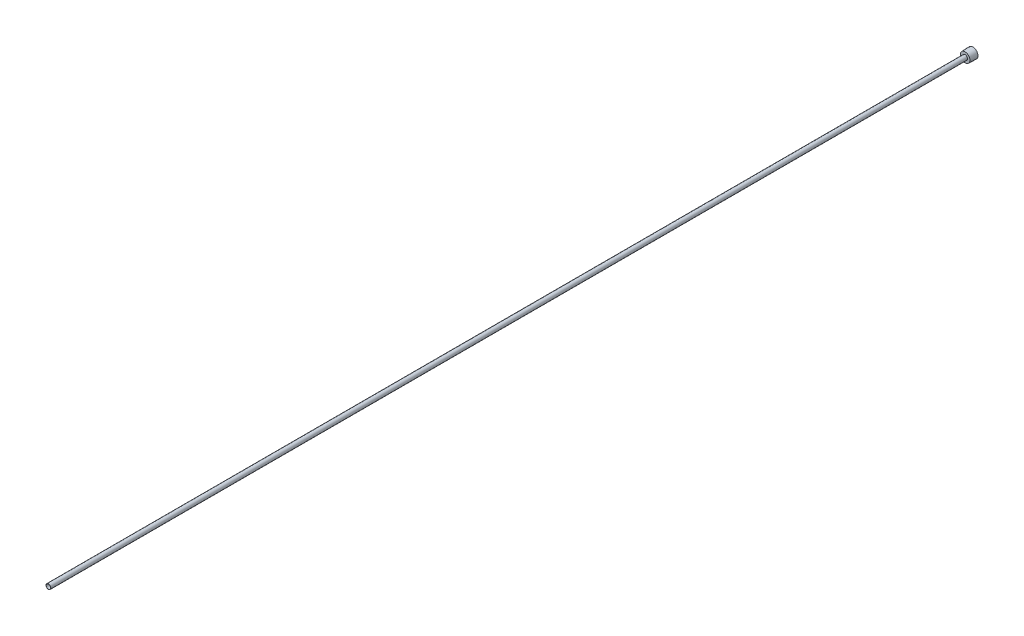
ISO-10303-21;
HEADER;
FILE_DESCRIPTION(('STEP AP214'),'2;1');
FILE_NAME('part.step','',(''),(''),'','','');
FILE_SCHEMA(('AUTOMOTIVE_DESIGN { 1 0 10303 214 1 1 1 1 }'));
ENDSEC;
DATA;
#1=APPLICATION_CONTEXT('core data for automotive mechanical design processes');
#2=APPLICATION_PROTOCOL_DEFINITION('international standard','automotive_design',2000,#1);
#3=PRODUCT_CONTEXT('',#1,'mechanical');
#4=PRODUCT('Part','Part','',(#3));
#5=PRODUCT_RELATED_PRODUCT_CATEGORY('part','',(#4));
#6=PRODUCT_DEFINITION_FORMATION('','',#4);
#7=PRODUCT_DEFINITION_CONTEXT('part definition',#1,'design');
#8=PRODUCT_DEFINITION('design','',#6,#7);
#9=PRODUCT_DEFINITION_SHAPE('','',#8);
#10=(LENGTH_UNIT() NAMED_UNIT(*) SI_UNIT(.MILLI.,.METRE.));
#11=(NAMED_UNIT(*) PLANE_ANGLE_UNIT() SI_UNIT($,.RADIAN.));
#12=(NAMED_UNIT(*) SI_UNIT($,.STERADIAN.) SOLID_ANGLE_UNIT());
#13=UNCERTAINTY_MEASURE_WITH_UNIT(LENGTH_MEASURE(1.E-05),#10,'distance_accuracy_value','');
#14=(GEOMETRIC_REPRESENTATION_CONTEXT(3) GLOBAL_UNCERTAINTY_ASSIGNED_CONTEXT((#13)) GLOBAL_UNIT_ASSIGNED_CONTEXT((#10,
#11,#12)) REPRESENTATION_CONTEXT('',''));
#15=CARTESIAN_POINT('',(0.,0.,0.));
#16=DIRECTION('',(0.,0.,1.));
#17=DIRECTION('',(1.,0.,0.));
#18=AXIS2_PLACEMENT_3D('',#15,#16,#17);
#19=CARTESIAN_POINT('',(0.,0.,0.));
#20=DIRECTION('',(0.,0.,1.));
#21=DIRECTION('',(1.,0.,0.));
#22=AXIS2_PLACEMENT_3D('',#19,#20,#21);
#23=CYLINDRICAL_SURFACE('',#22,2.921);
#24=CARTESIAN_POINT('',(0.,0.,1219.2));
#25=DIRECTION('',(0.,0.,1.));
#26=DIRECTION('',(1.,0.,0.));
#27=AXIS2_PLACEMENT_3D('',#24,#25,#26);
#28=CIRCLE('',#27,2.921);
#29=CARTESIAN_POINT('',(2.921,0.,1219.2));
#30=VERTEX_POINT('',#29);
#31=EDGE_CURVE('E142',#30,#30,#28,.T.);
#32=CARTESIAN_POINT('',(0.,0.,6.35));
#33=DIRECTION('',(0.,0.,-1.));
#34=DIRECTION('',(-1.,0.,0.));
#35=AXIS2_PLACEMENT_3D('',#32,#33,#34);
#36=CIRCLE('',#35,2.921);
#37=CARTESIAN_POINT('',(2.921,0.,6.35));
#38=VERTEX_POINT('',#37);
#39=EDGE_CURVE('E37',#38,#38,#36,.F.);
#40=CARTESIAN_POINT('',(2.921,0.,1219.2));
#41=CARTESIAN_POINT('',(2.921,0.,1206.56614583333));
#42=CARTESIAN_POINT('',(2.921,0.,1193.93229166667));
#43=CARTESIAN_POINT('',(2.921,0.,1168.66458333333));
#44=CARTESIAN_POINT('',(2.921,0.,1156.03072916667));
#45=CARTESIAN_POINT('',(2.921,0.,1130.76302083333));
#46=CARTESIAN_POINT('',(2.921,0.,1118.12916666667));
#47=CARTESIAN_POINT('',(2.921,0.,1092.86145833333));
#48=CARTESIAN_POINT('',(2.921,0.,1080.22760416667));
#49=CARTESIAN_POINT('',(2.921,0.,1054.95989583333));
#50=CARTESIAN_POINT('',(2.921,0.,1042.32604166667));
#51=CARTESIAN_POINT('',(2.921,0.,1017.05833333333));
#52=CARTESIAN_POINT('',(2.921,0.,1004.42447916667));
#53=CARTESIAN_POINT('',(2.921,0.,979.156770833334));
#54=CARTESIAN_POINT('',(2.921,0.,966.522916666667));
#55=CARTESIAN_POINT('',(2.921,0.,941.255208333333));
#56=CARTESIAN_POINT('',(2.921,0.,928.621354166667));
#57=CARTESIAN_POINT('',(2.921,0.,903.353645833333));
#58=CARTESIAN_POINT('',(2.921,0.,890.719791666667));
#59=CARTESIAN_POINT('',(2.921,0.,865.452083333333));
#60=CARTESIAN_POINT('',(2.921,0.,852.818229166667));
#61=CARTESIAN_POINT('',(2.921,0.,827.550520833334));
#62=CARTESIAN_POINT('',(2.921,0.,814.916666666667));
#63=CARTESIAN_POINT('',(2.921,0.,789.648958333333));
#64=CARTESIAN_POINT('',(2.921,0.,777.015104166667));
#65=CARTESIAN_POINT('',(2.921,0.,751.747395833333));
#66=CARTESIAN_POINT('',(2.921,0.,739.113541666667));
#67=CARTESIAN_POINT('',(2.921,0.,713.845833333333));
#68=CARTESIAN_POINT('',(2.921,0.,701.211979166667));
#69=CARTESIAN_POINT('',(2.921,0.,675.944270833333));
#70=CARTESIAN_POINT('',(2.921,0.,663.310416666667));
#71=CARTESIAN_POINT('',(2.921,0.,638.042708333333));
#72=CARTESIAN_POINT('',(2.921,0.,625.408854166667));
#73=CARTESIAN_POINT('',(2.921,0.,600.141145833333));
#74=CARTESIAN_POINT('',(2.921,0.,587.507291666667));
#75=CARTESIAN_POINT('',(2.921,0.,562.239583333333));
#76=CARTESIAN_POINT('',(2.921,0.,549.605729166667));
#77=CARTESIAN_POINT('',(2.921,0.,524.338020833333));
#78=CARTESIAN_POINT('',(2.921,0.,511.704166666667));
#79=CARTESIAN_POINT('',(2.921,0.,486.436458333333));
#80=CARTESIAN_POINT('',(2.921,0.,473.802604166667));
#81=CARTESIAN_POINT('',(2.921,0.,448.534895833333));
#82=CARTESIAN_POINT('',(2.921,0.,435.901041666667));
#83=CARTESIAN_POINT('',(2.921,0.,410.633333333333));
#84=CARTESIAN_POINT('',(2.921,0.,397.999479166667));
#85=CARTESIAN_POINT('',(2.921,0.,372.731770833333));
#86=CARTESIAN_POINT('',(2.921,0.,360.097916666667));
#87=CARTESIAN_POINT('',(2.921,0.,334.830208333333));
#88=CARTESIAN_POINT('',(2.921,0.,322.196354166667));
#89=CARTESIAN_POINT('',(2.921,0.,296.928645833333));
#90=CARTESIAN_POINT('',(2.921,0.,284.294791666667));
#91=CARTESIAN_POINT('',(2.921,0.,259.027083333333));
#92=CARTESIAN_POINT('',(2.921,0.,246.393229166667));
#93=CARTESIAN_POINT('',(2.921,0.,221.125520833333));
#94=CARTESIAN_POINT('',(2.921,0.,208.491666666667));
#95=CARTESIAN_POINT('',(2.921,0.,183.223958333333));
#96=CARTESIAN_POINT('',(2.921,0.,170.590104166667));
#97=CARTESIAN_POINT('',(2.921,0.,145.322395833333));
#98=CARTESIAN_POINT('',(2.921,0.,132.688541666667));
#99=CARTESIAN_POINT('',(2.921,0.,107.420833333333));
#100=CARTESIAN_POINT('',(2.921,0.,94.7869791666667));
#101=CARTESIAN_POINT('',(2.921,0.,69.5192708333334));
#102=CARTESIAN_POINT('',(2.921,0.,56.8854166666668));
#103=CARTESIAN_POINT('',(2.921,0.,31.6177083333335));
#104=CARTESIAN_POINT('',(2.921,0.,18.9838541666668));
#105=CARTESIAN_POINT('',(2.921,0.,6.35000000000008));
#106=B_SPLINE_CURVE_WITH_KNOTS('',3,(#40,#41,#42,#43,#44,#45,#46,#47,#48,#49,#50,#51,#52,#53,
#54,#55,#56,#57,#58,#59,#60,#61,#62,#63,#64,#65,#66,#67,#68,#69,#70,#71,#72,#73,#74,#75,#76,#77,
#78,#79,#80,#81,#82,#83,#84,#85,#86,#87,#88,#89,#90,#91,#92,#93,#94,#95,#96,#97,#98,#99,#100,
#101,#102,#103,#104,#105),.UNSPECIFIED.,.F.,.F.,(4,2,2,2,2,2,2,2,2,2,2,2,2,2,2,2,2,2,2,2,2,2,2,
2,2,2,2,2,2,2,2,2,4),(0.,37.9015625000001,75.803125,113.7046875,151.60625,189.5078125,
227.409375,265.3109375,303.2125,341.1140625,379.015625,416.9171875,454.81875,492.7203125,
530.621875,568.5234375,606.425,644.3265625,682.228125,720.1296875,758.03125,795.9328125,
833.834375,871.7359375,909.6375,947.5390625,985.440625,1023.3421875,1061.24375,1099.1453125,
1137.046875,1174.9484375,1212.85),.UNSPECIFIED.);
#107=EDGE_CURVE('BSEAM33',#30,#38,#106,.T.);
#108=ORIENTED_EDGE('',*,*,#31,.T.);
#109=ORIENTED_EDGE('',*,*,#39,.F.);
#110=ORIENTED_EDGE('',*,*,#107,.T.);
#111=ORIENTED_EDGE('',*,*,#107,.F.);
#112=EDGE_LOOP('',(#108,#110,#109,#111));
#113=FACE_BOUND('',#112,.T.);
#114=ADVANCED_FACE('F33',(#113),#23,.F.);
#115=CARTESIAN_POINT('',(0.,0.,0.));
#116=DIRECTION('',(0.,0.,-1.));
#117=DIRECTION('',(-1.,0.,0.));
#118=AXIS2_PLACEMENT_3D('',#115,#116,#117);
#119=CONICAL_SURFACE('',#118,6.7183,0.0364599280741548);
#120=CARTESIAN_POINT('',(0.,0.,10.3124));
#121=DIRECTION('',(0.,0.,1.));
#122=DIRECTION('',(1.,0.,0.));
#123=AXIS2_PLACEMENT_3D('',#120,#121,#122);
#124=CIRCLE('',#123,6.34214394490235);
#125=CARTESIAN_POINT('',(6.34214394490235,0.,10.3124));
#126=VERTEX_POINT('',#125);
#127=EDGE_CURVE('E11',#126,#126,#124,.T.);
#128=ORIENTED_EDGE('',*,*,#127,.F.);
#129=EDGE_LOOP('',(#128));
#130=FACE_BOUND('',#129,.T.);
#131=CARTESIAN_POINT('',(0.,0.,0.));
#132=DIRECTION('',(0.,0.,1.));
#133=DIRECTION('',(1.,0.,0.));
#134=AXIS2_PLACEMENT_3D('',#131,#132,#133);
#135=CIRCLE('',#134,6.7183);
#136=CARTESIAN_POINT('',(6.7183,0.,0.));
#137=VERTEX_POINT('',#136);
#138=EDGE_CURVE('E145',#137,#137,#135,.T.);
#139=ORIENTED_EDGE('',*,*,#138,.T.);
#140=EDGE_LOOP('',(#139));
#141=FACE_BOUND('',#140,.T.);
#142=ADVANCED_FACE('F35',(#130,#141),#119,.T.);
#143=CARTESIAN_POINT('',(0.,6.34214394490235,10.3124));
#144=DIRECTION('',(0.,0.,-1.));
#145=DIRECTION('',(-1.,0.,0.));
#146=AXIS2_PLACEMENT_3D('',#143,#144,#145);
#147=PLANE('',#146);
#148=CARTESIAN_POINT('',(0.,0.,10.3124));
#149=DIRECTION('',(0.,0.,1.));
#150=DIRECTION('',(1.,0.,0.));
#151=AXIS2_PLACEMENT_3D('',#148,#149,#150);
#152=CIRCLE('',#151,3.175);
#153=CARTESIAN_POINT('',(3.175,0.,10.3124));
#154=VERTEX_POINT('',#153);
#155=EDGE_CURVE('E42',#154,#154,#152,.T.);
#156=ORIENTED_EDGE('',*,*,#155,.F.);
#157=EDGE_LOOP('',(#156));
#158=FACE_BOUND('',#157,.T.);
#159=ORIENTED_EDGE('',*,*,#127,.T.);
#160=EDGE_LOOP('',(#159));
#161=FACE_BOUND('',#160,.T.);
#162=ADVANCED_FACE('F156',(#158,#161),#147,.F.);
#163=CARTESIAN_POINT('',(0.,0.,331.124179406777));
#164=DIRECTION('',(0.,0.,1.));
#165=DIRECTION('',(1.,0.,0.));
#166=AXIS2_PLACEMENT_3D('',#163,#164,#165);
#167=CYLINDRICAL_SURFACE('',#166,3.17499999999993);
#168=CARTESIAN_POINT('',(0.,0.,1219.2));
#169=DIRECTION('',(0.,0.,1.));
#170=DIRECTION('',(1.,0.,0.));
#171=AXIS2_PLACEMENT_3D('',#168,#169,#170);
#172=CIRCLE('',#171,3.17499999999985);
#173=CARTESIAN_POINT('',(3.17499999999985,0.,1219.2));
#174=VERTEX_POINT('',#173);
#175=EDGE_CURVE('E148',#174,#174,#172,.T.);
#176=ORIENTED_EDGE('',*,*,#175,.F.);
#177=EDGE_LOOP('',(#176));
#178=FACE_BOUND('',#177,.T.);
#179=ORIENTED_EDGE('',*,*,#155,.T.);
#180=EDGE_LOOP('',(#179));
#181=FACE_BOUND('',#180,.T.);
#182=ADVANCED_FACE('F154',(#178,#181),#167,.T.);
#183=CARTESIAN_POINT('',(0.,3.17499999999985,1219.2));
#184=DIRECTION('',(0.,0.,-1.));
#185=DIRECTION('',(-1.,0.,0.));
#186=AXIS2_PLACEMENT_3D('',#183,#184,#185);
#187=PLANE('',#186);
#188=ORIENTED_EDGE('',*,*,#31,.F.);
#189=EDGE_LOOP('',(#188));
#190=FACE_BOUND('',#189,.T.);
#191=ORIENTED_EDGE('',*,*,#175,.T.);
#192=EDGE_LOOP('',(#191));
#193=FACE_BOUND('',#192,.T.);
#194=ADVANCED_FACE('F167',(#190,#193),#187,.F.);
#195=CARTESIAN_POINT('',(0.,0.,0.));
#196=DIRECTION('',(0.,0.,1.));
#197=DIRECTION('',(1.,0.,0.));
#198=AXIS2_PLACEMENT_3D('',#195,#196,#197);
#199=PLANE('',#198);
#200=DIRECTION('',(-0.866025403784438,-0.5,0.));
#201=VECTOR('',#200,1.);
#202=CARTESIAN_POINT('',(3.175,-1.83308710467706,0.));
#203=LINE('',#202,#201);
#204=CARTESIAN_POINT('',(3.175,-1.83308710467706,0.));
#205=VERTEX_POINT('',#204);
#206=CARTESIAN_POINT('',(0.,-3.66617420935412,0.));
#207=VERTEX_POINT('',#206);
#208=EDGE_CURVE('E124',#205,#207,#203,.T.);
#209=ORIENTED_EDGE('',*,*,#208,.F.);
#210=DIRECTION('',(0.,-1.,0.));
#211=VECTOR('',#210,1.);
#212=CARTESIAN_POINT('',(3.175,1.83308710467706,0.));
#213=LINE('',#212,#211);
#214=CARTESIAN_POINT('',(3.175,1.83308710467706,0.));
#215=VERTEX_POINT('',#214);
#216=EDGE_CURVE('E49',#215,#205,#213,.T.);
#217=ORIENTED_EDGE('',*,*,#216,.F.);
#218=DIRECTION('',(0.866025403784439,-0.5,0.));
#219=VECTOR('',#218,1.);
#220=CARTESIAN_POINT('',(0.,3.66617420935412,0.));
#221=LINE('',#220,#219);
#222=CARTESIAN_POINT('',(0.,3.66617420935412,0.));
#223=VERTEX_POINT('',#222);
#224=EDGE_CURVE('E133',#223,#215,#221,.T.);
#225=ORIENTED_EDGE('',*,*,#224,.F.);
#226=DIRECTION('',(0.866025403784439,0.5,0.));
#227=VECTOR('',#226,1.);
#228=CARTESIAN_POINT('',(-3.175,1.83308710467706,0.));
#229=LINE('',#228,#227);
#230=CARTESIAN_POINT('',(-3.175,1.83308710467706,0.));
#231=VERTEX_POINT('',#230);
#232=EDGE_CURVE('E131',#231,#223,#229,.T.);
#233=ORIENTED_EDGE('',*,*,#232,.F.);
#234=DIRECTION('',(0.,1.,0.));
#235=VECTOR('',#234,1.);
#236=CARTESIAN_POINT('',(-3.175,-1.83308710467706,0.));
#237=LINE('',#236,#235);
#238=CARTESIAN_POINT('',(-3.175,-1.83308710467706,0.));
#239=VERTEX_POINT('',#238);
#240=EDGE_CURVE('E97',#239,#231,#237,.T.);
#241=ORIENTED_EDGE('',*,*,#240,.F.);
#242=DIRECTION('',(-0.866025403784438,0.5,0.));
#243=VECTOR('',#242,1.);
#244=CARTESIAN_POINT('',(0.,-3.66617420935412,0.));
#245=LINE('',#244,#243);
#246=EDGE_CURVE('E127',#207,#239,#245,.T.);
#247=ORIENTED_EDGE('',*,*,#246,.F.);
#248=EDGE_LOOP('',(#209,#217,#225,#233,#241,#247));
#249=FACE_BOUND('',#248,.T.);
#250=ORIENTED_EDGE('',*,*,#138,.F.);
#251=EDGE_LOOP('',(#250));
#252=FACE_BOUND('',#251,.T.);
#253=ADVANCED_FACE('F165',(#249,#252),#199,.F.);
#254=CARTESIAN_POINT('',(3.175,-1.83308710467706,6.35));
#255=DIRECTION('',(0.,0.,-1.));
#256=DIRECTION('',(-1.,0.,0.));
#257=AXIS2_PLACEMENT_3D('',#254,#255,#256);
#258=PLANE('',#257);
#259=DIRECTION('',(0.,-1.,0.));
#260=VECTOR('',#259,1.);
#261=CARTESIAN_POINT('',(3.175,1.83308710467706,6.35));
#262=LINE('',#261,#260);
#263=CARTESIAN_POINT('',(3.175,1.83308710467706,6.35));
#264=VERTEX_POINT('',#263);
#265=CARTESIAN_POINT('',(3.175,-1.83308710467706,6.35));
#266=VERTEX_POINT('',#265);
#267=EDGE_CURVE('E135',#264,#266,#262,.T.);
#268=ORIENTED_EDGE('',*,*,#267,.T.);
#269=DIRECTION('',(-0.866025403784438,-0.5,0.));
#270=VECTOR('',#269,1.);
#271=CARTESIAN_POINT('',(3.175,-1.83308710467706,6.35));
#272=LINE('',#271,#270);
#273=CARTESIAN_POINT('',(0.,-3.66617420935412,6.35));
#274=VERTEX_POINT('',#273);
#275=EDGE_CURVE('E118',#266,#274,#272,.T.);
#276=ORIENTED_EDGE('',*,*,#275,.T.);
#277=DIRECTION('',(-0.866025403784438,0.5,0.));
#278=VECTOR('',#277,1.);
#279=CARTESIAN_POINT('',(0.,-3.66617420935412,6.35));
#280=LINE('',#279,#278);
#281=CARTESIAN_POINT('',(-3.175,-1.83308710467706,6.35));
#282=VERTEX_POINT('',#281);
#283=EDGE_CURVE('E116',#274,#282,#280,.T.);
#284=ORIENTED_EDGE('',*,*,#283,.T.);
#285=DIRECTION('',(0.,1.,0.));
#286=VECTOR('',#285,1.);
#287=CARTESIAN_POINT('',(-3.175,-1.83308710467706,6.35));
#288=LINE('',#287,#286);
#289=CARTESIAN_POINT('',(-3.175,1.83308710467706,6.35));
#290=VERTEX_POINT('',#289);
#291=EDGE_CURVE('E94',#282,#290,#288,.T.);
#292=ORIENTED_EDGE('',*,*,#291,.T.);
#293=DIRECTION('',(0.866025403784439,0.5,0.));
#294=VECTOR('',#293,1.);
#295=CARTESIAN_POINT('',(-3.175,1.83308710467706,6.35));
#296=LINE('',#295,#294);
#297=CARTESIAN_POINT('',(0.,3.66617420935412,6.35));
#298=VERTEX_POINT('',#297);
#299=EDGE_CURVE('E105',#290,#298,#296,.T.);
#300=ORIENTED_EDGE('',*,*,#299,.T.);
#301=DIRECTION('',(0.866025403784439,-0.5,0.));
#302=VECTOR('',#301,1.);
#303=CARTESIAN_POINT('',(0.,3.66617420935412,6.35));
#304=LINE('',#303,#302);
#305=EDGE_CURVE('E109',#298,#264,#304,.T.);
#306=ORIENTED_EDGE('',*,*,#305,.T.);
#307=EDGE_LOOP('',(#268,#276,#284,#292,#300,#306));
#308=FACE_BOUND('',#307,.T.);
#309=ORIENTED_EDGE('',*,*,#39,.T.);
#310=EDGE_LOOP('',(#309));
#311=FACE_BOUND('',#310,.T.);
#312=ADVANCED_FACE('F112',(#308,#311),#258,.T.);
#313=CARTESIAN_POINT('',(3.175,1.83308710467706,6.35));
#314=DIRECTION('',(1.,0.,0.));
#315=DIRECTION('',(0.,0.,-1.));
#316=AXIS2_PLACEMENT_3D('',#313,#314,#315);
#317=PLANE('',#316);
#318=ORIENTED_EDGE('',*,*,#216,.T.);
#319=DIRECTION('',(0.,0.,-1.));
#320=VECTOR('',#319,1.);
#321=CARTESIAN_POINT('',(3.175,-1.83308710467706,6.35));
#322=LINE('',#321,#320);
#323=EDGE_CURVE('E79',#266,#205,#322,.T.);
#324=ORIENTED_EDGE('',*,*,#323,.F.);
#325=ORIENTED_EDGE('',*,*,#267,.F.);
#326=DIRECTION('',(0.,0.,-1.));
#327=VECTOR('',#326,1.);
#328=CARTESIAN_POINT('',(3.175,1.83308710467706,6.35));
#329=LINE('',#328,#327);
#330=EDGE_CURVE('E57',#264,#215,#329,.T.);
#331=ORIENTED_EDGE('',*,*,#330,.T.);
#332=EDGE_LOOP('',(#318,#324,#325,#331));
#333=FACE_BOUND('',#332,.T.);
#334=ADVANCED_FACE('F174',(#333),#317,.F.);
#335=CARTESIAN_POINT('',(0.,3.66617420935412,6.35));
#336=DIRECTION('',(0.5,0.866025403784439,0.));
#337=DIRECTION('',(-0.866025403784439,0.5,0.));
#338=AXIS2_PLACEMENT_3D('',#335,#336,#337);
#339=PLANE('',#338);
#340=ORIENTED_EDGE('',*,*,#224,.T.);
#341=ORIENTED_EDGE('',*,*,#330,.F.);
#342=ORIENTED_EDGE('',*,*,#305,.F.);
#343=DIRECTION('',(0.,0.,-1.));
#344=VECTOR('',#343,1.);
#345=CARTESIAN_POINT('',(0.,3.66617420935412,6.35));
#346=LINE('',#345,#344);
#347=EDGE_CURVE('E101',#298,#223,#346,.T.);
#348=ORIENTED_EDGE('',*,*,#347,.T.);
#349=EDGE_LOOP('',(#340,#341,#342,#348));
#350=FACE_BOUND('',#349,.T.);
#351=ADVANCED_FACE('F188',(#350),#339,.F.);
#352=CARTESIAN_POINT('',(-3.175,1.83308710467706,6.35));
#353=DIRECTION('',(-0.5,0.866025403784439,0.));
#354=DIRECTION('',(-0.866025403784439,-0.5,0.));
#355=AXIS2_PLACEMENT_3D('',#352,#353,#354);
#356=PLANE('',#355);
#357=ORIENTED_EDGE('',*,*,#232,.T.);
#358=ORIENTED_EDGE('',*,*,#347,.F.);
#359=ORIENTED_EDGE('',*,*,#299,.F.);
#360=DIRECTION('',(0.,0.,-1.));
#361=VECTOR('',#360,1.);
#362=CARTESIAN_POINT('',(-3.175,1.83308710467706,6.35));
#363=LINE('',#362,#361);
#364=EDGE_CURVE('E90',#290,#231,#363,.T.);
#365=ORIENTED_EDGE('',*,*,#364,.T.);
#366=EDGE_LOOP('',(#357,#358,#359,#365));
#367=FACE_BOUND('',#366,.T.);
#368=ADVANCED_FACE('F106',(#367),#356,.F.);
#369=CARTESIAN_POINT('',(-3.175,-1.83308710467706,6.35));
#370=DIRECTION('',(-1.,0.,0.));
#371=DIRECTION('',(0.,-1.,0.));
#372=AXIS2_PLACEMENT_3D('',#369,#370,#371);
#373=PLANE('',#372);
#374=ORIENTED_EDGE('',*,*,#240,.T.);
#375=ORIENTED_EDGE('',*,*,#364,.F.);
#376=ORIENTED_EDGE('',*,*,#291,.F.);
#377=DIRECTION('',(0.,0.,-1.));
#378=VECTOR('',#377,1.);
#379=CARTESIAN_POINT('',(-3.175,-1.83308710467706,6.35));
#380=LINE('',#379,#378);
#381=EDGE_CURVE('E102',#282,#239,#380,.T.);
#382=ORIENTED_EDGE('',*,*,#381,.T.);
#383=EDGE_LOOP('',(#374,#375,#376,#382));
#384=FACE_BOUND('',#383,.T.);
#385=ADVANCED_FACE('F92',(#384),#373,.F.);
#386=CARTESIAN_POINT('',(0.,-3.66617420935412,6.35));
#387=DIRECTION('',(-0.5,-0.866025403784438,0.));
#388=DIRECTION('',(0.866025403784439,-0.5,0.));
#389=AXIS2_PLACEMENT_3D('',#386,#387,#388);
#390=PLANE('',#389);
#391=ORIENTED_EDGE('',*,*,#246,.T.);
#392=ORIENTED_EDGE('',*,*,#381,.F.);
#393=ORIENTED_EDGE('',*,*,#283,.F.);
#394=DIRECTION('',(0.,0.,-1.));
#395=VECTOR('',#394,1.);
#396=CARTESIAN_POINT('',(0.,-3.66617420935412,6.35));
#397=LINE('',#396,#395);
#398=EDGE_CURVE('E139',#274,#207,#397,.T.);
#399=ORIENTED_EDGE('',*,*,#398,.T.);
#400=EDGE_LOOP('',(#391,#392,#393,#399));
#401=FACE_BOUND('',#400,.T.);
#402=ADVANCED_FACE('F192',(#401),#390,.F.);
#403=CARTESIAN_POINT('',(3.175,-1.83308710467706,6.35));
#404=DIRECTION('',(0.5,-0.866025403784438,0.));
#405=DIRECTION('',(0.866025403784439,0.5,0.));
#406=AXIS2_PLACEMENT_3D('',#403,#404,#405);
#407=PLANE('',#406);
#408=ORIENTED_EDGE('',*,*,#208,.T.);
#409=ORIENTED_EDGE('',*,*,#398,.F.);
#410=ORIENTED_EDGE('',*,*,#275,.F.);
#411=ORIENTED_EDGE('',*,*,#323,.T.);
#412=EDGE_LOOP('',(#408,#409,#410,#411));
#413=FACE_BOUND('',#412,.T.);
#414=ADVANCED_FACE('F189',(#413),#407,.F.);
#415=CLOSED_SHELL('',(#114,#142,#162,#182,#194,#253,#312,#334,#351,#368,#385,#402,#414));
#416=MANIFOLD_SOLID_BREP('B2',#415);
#417=ADVANCED_BREP_SHAPE_REPRESENTATION('',(#18,#416),#14);
#418=SHAPE_DEFINITION_REPRESENTATION(#9,#417);
ENDSEC;
END-ISO-10303-21;
